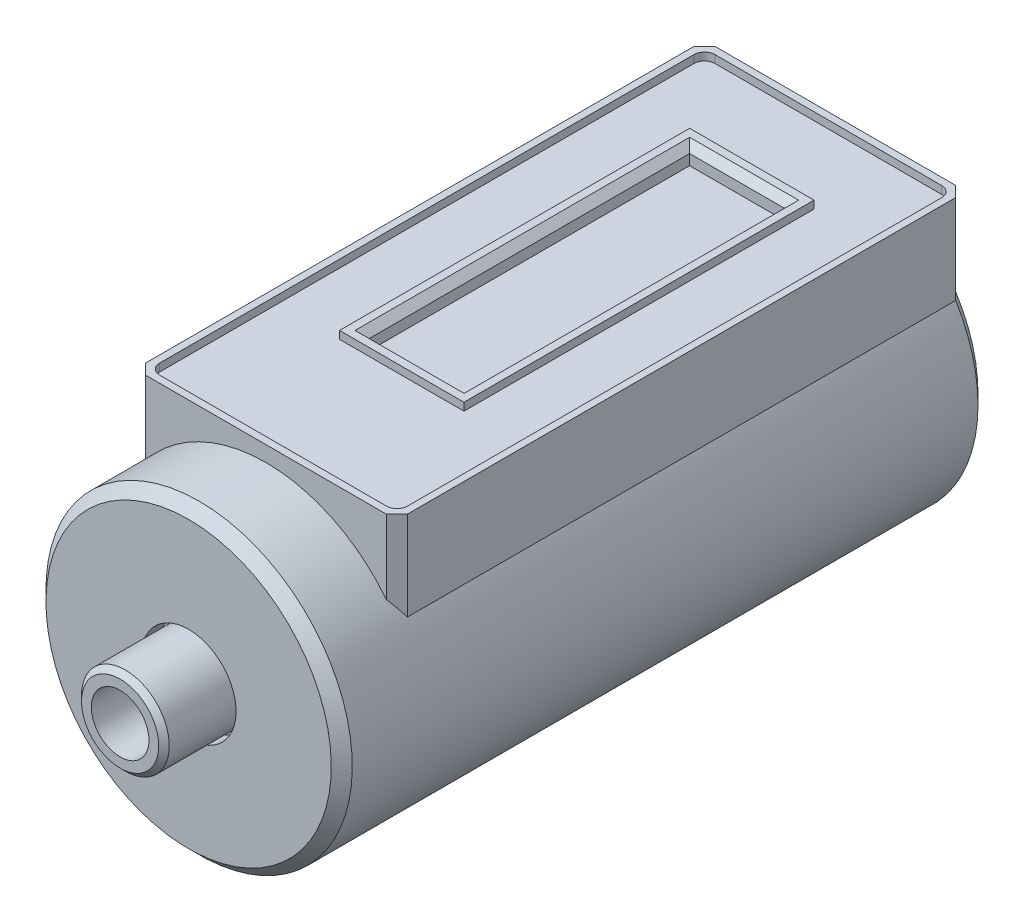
from build123d import *

# Parameters (mm, degrees)
EXTRUDE1_DEPTH     = 12.19
CHAMFER1_SIZE      = 0.76
SKETCH4_W          = 8.99
SKETCH4_H          = 25.3
CUT_EXTRUDE1_DEPTH = 0.56
SKETCH5_W          = 6.86
SKETCH5_H          = 23.16
CUT_EXTRUDE2_DEPTH = 1.27
CHAMFER2_SIZE      = 0.51
HOLE1_D            = 4.1656
HOLE1_DEPTH        = 6.35
HOLE1_TIP          = 1.251472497


with BuildPart() as part:
    # Sketch2 → Revolve1 (revolve)
    with BuildSketch(Plane(origin=(0, 0, 0), x_dir=(0, 0, -1), z_dir=(1, 0, 0))):
        Polygon((161.035, 0), (161.035, 2.79), (161.415, 3.17), (167.255, 3.17), (167.255, 3.43), (165.985, 3.43), (165.985, 10.31), (166.745, 11.07), (212.725, 11.07), (212.725, 0), align=None)
    revolve(axis=Axis((0, 0, -212.725), (0, 0, 1)))

    # Sketch3 → Extrude1 (add)
    with BuildSketch(Plane(origin=(0, 0, 0), x_dir=(1, 0, 0), z_dir=(0, 1, 0))):
        Polygon((-9.46, 212.725), (9.46, 212.725), (9.46, 172.335), (8.7, 171.575), (-8.7, 171.575), (-9.46, 172.335), align=None)
    extrude(amount=EXTRUDE1_DEPTH)

    # Chamfer1
    chamfer1_edges = [part.edges().sort_by_distance(p)[0] for p in [
        (0, -11.07, -212.725),
        (-9.46, 8.969599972, -212.725),
        (9.46, 8.969599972, -212.725),
    ]]
    chamfer(chamfer1_edges, length=CHAMFER1_SIZE)

    # Sketch4 → Cut-Extrude1 (cut)
    with BuildSketch(Plane(origin=(0, 12.19, 0), x_dir=(1, 0, 0), z_dir=(0, 1, 0))):
        with BuildLine():
            Line((-8.19, 212.215), (8.2, 212.215))
            ThreePointArc((8.2, 212.215), (8.737401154, 211.992401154), (8.96, 211.455))
            Line((8.96, 211.455), (8.96, 172.845))
            ThreePointArc((8.96, 172.845), (8.737401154, 172.307598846), (8.2, 172.085))
            Line((8.2, 172.085), (-8.19, 172.085))
            ThreePointArc((-8.19, 172.085), (-8.727401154, 172.307598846), (-8.95, 172.845))
            Line((-8.95, 172.845), (-8.95, 211.455))
            ThreePointArc((-8.95, 211.455), (-8.727401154, 211.992401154), (-8.19, 212.215))
        make_face()
        with Locations((0.005, 194.035)):
            Rectangle(SKETCH4_W, SKETCH4_H, mode=Mode.SUBTRACT)
    extrude(amount=-CUT_EXTRUDE1_DEPTH, mode=Mode.SUBTRACT)

    # Sketch5 → Cut-Extrude2 (cut)
    with BuildSketch(Plane(origin=(0, 12.19, 0), x_dir=(1, 0, 0), z_dir=(0, 1, 0))):
        with Locations((0.01, 194.035)):
            Rectangle(SKETCH5_W, SKETCH5_H)
    extrude(amount=-CUT_EXTRUDE2_DEPTH, mode=Mode.SUBTRACT)

    # Chamfer2
    chamfer2_edges = [part.edges().sort_by_distance(p)[0] for p in [
        (-3.42, 12.19, -194.035),
        (0.01, 12.19, -182.455),
        (3.44, 12.19, -194.035),
        (0.01, 12.19, -205.615),
    ]]
    chamfer(chamfer2_edges, length=CHAMFER2_SIZE)

    # Hole1
    with Locations(Plane.XY.offset(-161.035)):
        with Locations((0, 0)):
            Hole(HOLE1_D / 2, depth=HOLE1_DEPTH)
            with Locations((0, 0, -(HOLE1_DEPTH + HOLE1_TIP / 2))):  # 118° drill point
                Cone(0, HOLE1_D / 2, HOLE1_TIP, mode=Mode.SUBTRACT)


solid = part.part
